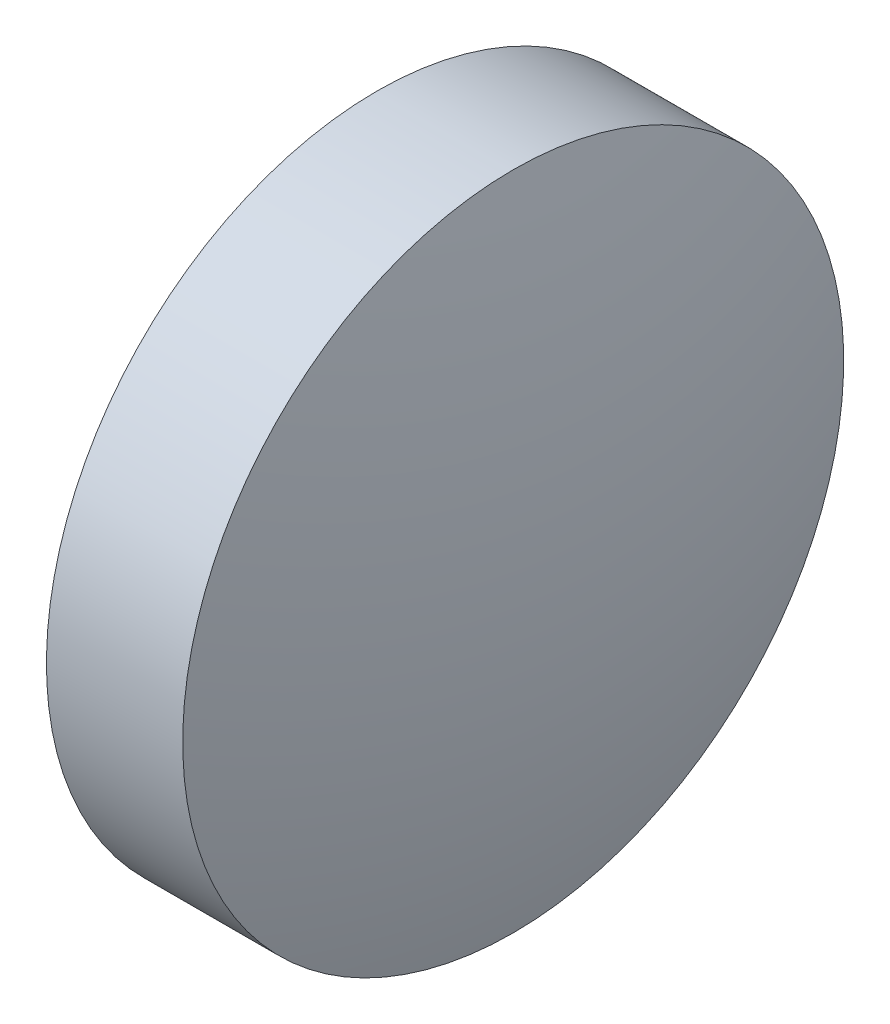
ISO-10303-21;
HEADER;
FILE_DESCRIPTION(('STEP AP214'),'2;1');
FILE_NAME('part.step','',(''),(''),'','','');
FILE_SCHEMA(('AUTOMOTIVE_DESIGN { 1 0 10303 214 1 1 1 1 }'));
ENDSEC;
DATA;
#1=APPLICATION_CONTEXT('core data for automotive mechanical design processes');
#2=APPLICATION_PROTOCOL_DEFINITION('international standard','automotive_design',2000,#1);
#3=PRODUCT_CONTEXT('',#1,'mechanical');
#4=PRODUCT('Part','Part','',(#3));
#5=PRODUCT_RELATED_PRODUCT_CATEGORY('part','',(#4));
#6=PRODUCT_DEFINITION_FORMATION('','',#4);
#7=PRODUCT_DEFINITION_CONTEXT('part definition',#1,'design');
#8=PRODUCT_DEFINITION('design','',#6,#7);
#9=PRODUCT_DEFINITION_SHAPE('','',#8);
#10=(LENGTH_UNIT() NAMED_UNIT(*) SI_UNIT(.MILLI.,.METRE.));
#11=(NAMED_UNIT(*) PLANE_ANGLE_UNIT() SI_UNIT($,.RADIAN.));
#12=(NAMED_UNIT(*) SI_UNIT($,.STERADIAN.) SOLID_ANGLE_UNIT());
#13=UNCERTAINTY_MEASURE_WITH_UNIT(LENGTH_MEASURE(1.E-05),#10,'distance_accuracy_value','');
#14=(GEOMETRIC_REPRESENTATION_CONTEXT(3) GLOBAL_UNCERTAINTY_ASSIGNED_CONTEXT((#13)) GLOBAL_UNIT_ASSIGNED_CONTEXT((#10,
#11,#12)) REPRESENTATION_CONTEXT('',''));
#15=CARTESIAN_POINT('',(0.,0.,0.));
#16=DIRECTION('',(0.,0.,1.));
#17=DIRECTION('',(1.,0.,0.));
#18=AXIS2_PLACEMENT_3D('',#15,#16,#17);
#19=CARTESIAN_POINT('',(0.,0.,0.));
#20=DIRECTION('',(1.,0.,0.));
#21=DIRECTION('',(0.,1.,0.));
#22=AXIS2_PLACEMENT_3D('',#19,#20,#21);
#23=PLANE('',#22);
#24=CARTESIAN_POINT('',(0.,0.,0.));
#25=DIRECTION('',(1.,0.,0.));
#26=DIRECTION('',(0.,1.,0.));
#27=AXIS2_PLACEMENT_3D('',#24,#25,#26);
#28=CIRCLE('',#27,24.638);
#29=CARTESIAN_POINT('',(0.,24.638,0.));
#30=VERTEX_POINT('',#29);
#31=EDGE_CURVE('E10',#30,#30,#28,.T.);
#32=ORIENTED_EDGE('',*,*,#31,.F.);
#33=EDGE_LOOP('',(#32));
#34=FACE_BOUND('',#33,.T.);
#35=ADVANCED_FACE('F28',(#34),#23,.F.);
#36=CARTESIAN_POINT('',(13.6057940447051,0.,0.));
#37=DIRECTION('',(1.,0.,0.));
#38=DIRECTION('',(0.,1.,0.));
#39=AXIS2_PLACEMENT_3D('',#36,#37,#38);
#40=CYLINDRICAL_SURFACE('',#39,24.638);
#41=CARTESIAN_POINT('',(10.16,0.,0.));
#42=DIRECTION('',(1.,0.,0.));
#43=DIRECTION('',(0.,1.,0.));
#44=AXIS2_PLACEMENT_3D('',#41,#42,#43);
#45=CIRCLE('',#44,24.638);
#46=CARTESIAN_POINT('',(10.16,24.638,0.));
#47=VERTEX_POINT('',#46);
#48=EDGE_CURVE('E34',#47,#47,#45,.T.);
#49=ORIENTED_EDGE('',*,*,#48,.F.);
#50=EDGE_LOOP('',(#49));
#51=FACE_BOUND('',#50,.T.);
#52=ORIENTED_EDGE('',*,*,#31,.T.);
#53=EDGE_LOOP('',(#52));
#54=FACE_BOUND('',#53,.T.);
#55=ADVANCED_FACE('F42',(#51,#54),#40,.T.);
#56=CARTESIAN_POINT('',(-76.2,0.,0.));
#57=DIRECTION('',(1.,0.,0.));
#58=DIRECTION('',(0.,-1.,0.));
#59=AXIS2_PLACEMENT_3D('',#56,#57,#58);
#60=SPHERICAL_SURFACE('',#59,89.8057940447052);
#61=ORIENTED_EDGE('',*,*,#48,.T.);
#62=EDGE_LOOP('',(#61));
#63=FACE_BOUND('',#62,.T.);
#64=ADVANCED_FACE('F40',(#63),#60,.T.);
#65=CLOSED_SHELL('',(#35,#55,#64));
#66=MANIFOLD_SOLID_BREP('B2',#65);
#67=ADVANCED_BREP_SHAPE_REPRESENTATION('',(#18,#66),#14);
#68=SHAPE_DEFINITION_REPRESENTATION(#9,#67);
ENDSEC;
END-ISO-10303-21;
